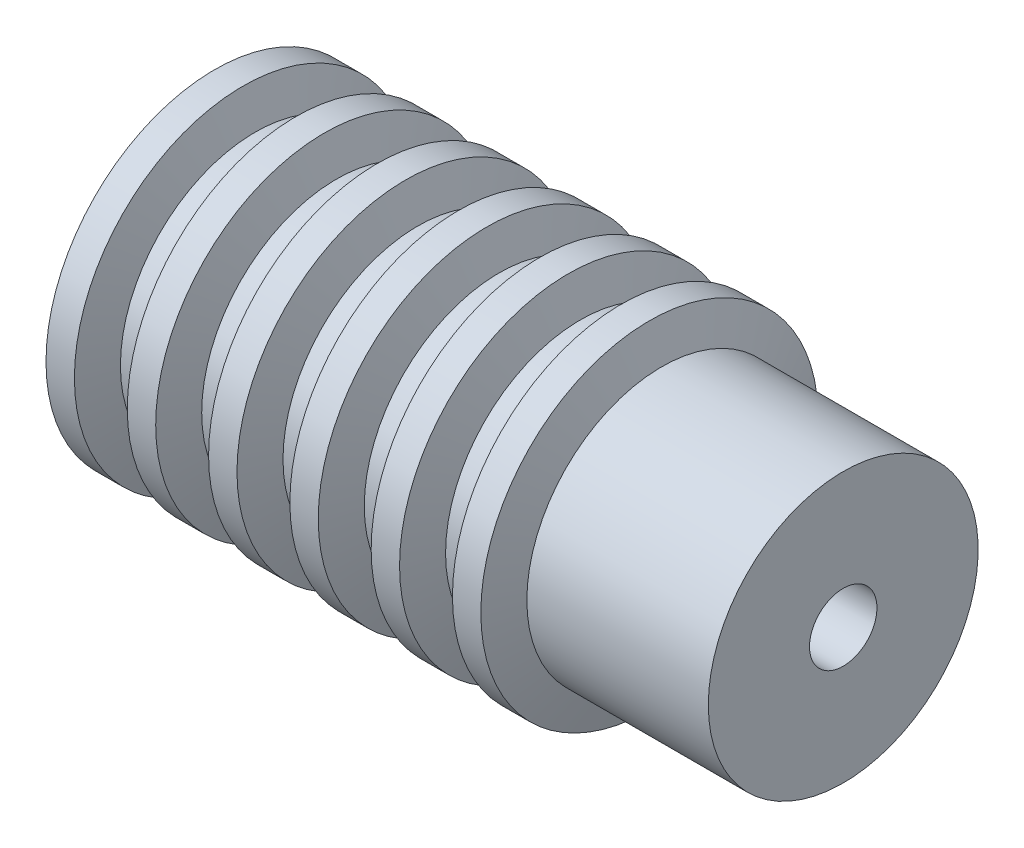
from build123d import *


with BuildPart() as part:
    # Sketch1 → Revolve1 (revolve)
    with BuildSketch(Plane.XY, mode=Mode.PRIVATE) as revolve1_sk:
        Polygon((13.62, 4), (14, 4), (19, 4), (19, 1), (0, 1), (0, 4), (0.363970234, 5), (1.206029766, 5), (1.57, 4), (2.41, 4), (2.773970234, 5), (3.616029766, 5), (3.98, 4), (4.82, 4), (5.183970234, 5), (6.026029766, 5), (6.39, 4), (7.23, 4), (7.593970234, 5), (8.436029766, 5), (8.8, 4), (9.64, 4), (10.003970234, 5), (10.846029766, 5), (11.21, 4), (12.05, 4), (12.413970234, 5), (13.256029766, 5), align=None)
    revolve(revolve1_sk.sketch.rotate(Axis((0, 0, 0), (1, 0, 0)), 90), axis=Axis((0, 0, 0), (1, 0, 0)))


solid = part.part
